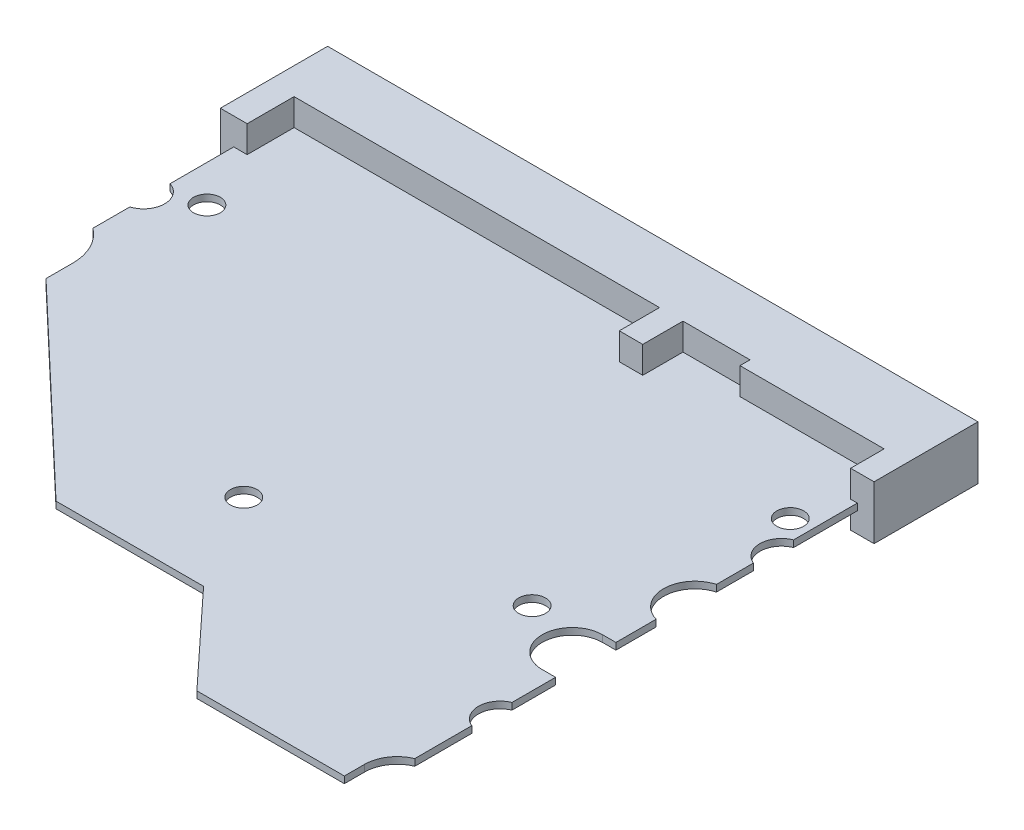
from build123d import *

# Parameters (mm, degrees)
SKETCH2_W           = 97
SKETCH2_H           = 89
BOSS_EXTRUDE2_DEPTH = 8
CUT_EXTRUDE1_DEPTH  = 4
CUT_EXTRUDE2_DEPTH  = 3
CUT_EXTRUDE3_DEPTH  = 3.5
CUT_EXTRUDE4_DEPTH  = 3.5
SKETCH9_R           = 2
CUT_EXTRUDE5_DEPTH  = 3.5


with BuildPart() as part:
    # Sketch2 → Boss-Extrude2 (new body)
    with BuildSketch(Plane(origin=(0, 0, 0), x_dir=(1, 0, 0), z_dir=(0, 1, 0))):
        Rectangle(SKETCH2_W, SKETCH2_H)
    extrude(amount=BOSS_EXTRUDE2_DEPTH)

    # Sketch3 → Cut-Extrude1 (cut)
    with BuildSketch(Plane(origin=(0, 8, 0), x_dir=(1, 0, 0), z_dir=(0, 1, 0))):
        Polygon((-48.5, 28.5), (-44.5, 28.5), (-44.5, 35.5), (10, 35.5), (10, 29.5), (13.5, 29.5), (13.5, 35.5), (23.5, 35.5), (23.5, 34), (45, 34), (45, 29), (48.5, 29), (48.5, -44.5), (-48.5, -44.5), align=None)
    extrude(amount=-CUT_EXTRUDE1_DEPTH, mode=Mode.SUBTRACT)

    # Sketch4 → Cut-Extrude2 (cut)
    with BuildSketch(Plane.XZ):
        Polygon((48.5, 44.5), (48.5, -29), (45, -29), (45, -37), (13.5, -37), (13.5, -30), (10, -30), (10, -37), (-44.5, -37), (-44.5, -28.5), (-48.5, -28.5), (-48.5, 44.5), align=None)
    extrude(amount=-CUT_EXTRUDE2_DEPTH, mode=Mode.SUBTRACT)

    # Sketch7 → Cut-Extrude3 (cut)
    with BuildSketch(Plane.XZ.offset(-3)):
        with BuildLine():
            Line((48.5, -29), (46, -29))
            Line((46, -29), (46, -19.5))
            ThreePointArc((46, -19.5), (43.974879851, -16.5), (46, -13.5))
            Line((46, -13.5), (46, -8))
            ThreePointArc((46, -8), (42.607142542, -3.5), (46, 1))
            Line((46, 1), (46, 7))
            Line((46, 7), (44, 7))
            ThreePointArc((44, 7), (39.5, 11.5), (44, 16))
            Line((44, 16), (46, 16))
            Line((46, 16), (46, 22.5))
            ThreePointArc((46, 22.5), (43.992118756, 25.5), (46, 28.5))
            Line((46, 28.5), (46, 37))
            ThreePointArc((46, 37), (43.818754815, 38.795836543), (43, 41.5))
            Line((43, 41.5), (43, 44.5))
            Line((43, 44.5), (46, 44.5))
            Line((46, 44.5), (48.5, 44.5))
            Line((48.5, 44.5), (48.5, -29))
        make_face()
    extrude(amount=-CUT_EXTRUDE3_DEPTH, mode=Mode.SUBTRACT)

    # Sketch8 → Cut-Extrude4 (cut)
    with BuildSketch(Plane.XZ.offset(-3)):
        with BuildLine():
            Line((21, 44.5), (8, 30.5))
            Line((8, 30.5), (-14, 30.5))
            Line((-14, 30.5), (-43.5, 2.5))
            Line((-43.5, 2.5), (-43.5, -1.5))
            ThreePointArc((-43.5, -1.5), (-44.291796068, -4.854101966), (-46.5, -7.5))
            Line((-46.5, -7.5), (-46.5, -13))
            ThreePointArc((-46.5, -13), (-44.300762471, -16), (-46.5, -19))
            Line((-46.5, -19), (-46.5, -28.5))
            Line((-46.5, -28.5), (-48.5, -28.5))
            Line((-48.5, -28.5), (-48.5, 44.5))
            Line((-48.5, 44.5), (21, 44.5))
        make_face()
    extrude(amount=-CUT_EXTRUDE4_DEPTH, mode=Mode.SUBTRACT)

    # Sketch9 → Cut-Extrude5 (cut)
    with BuildSketch(Plane.XZ.offset(-3)):
        with Locations(Location((43, -22, 0), (0, 0, 270))):
            Circle(SKETCH9_R)
        with Locations(Location((35, 8.5, 0), (0, 0, 270))):
            Circle(SKETCH9_R)
        with Locations(Location((-0.5, 16, 0), (0, 0, 270))):
            Circle(SKETCH9_R)
        with Locations(Location((-41, -19, 0), (0, 0, 270))):
            Circle(SKETCH9_R)
    extrude(amount=-CUT_EXTRUDE5_DEPTH, mode=Mode.SUBTRACT)


solid = part.part
